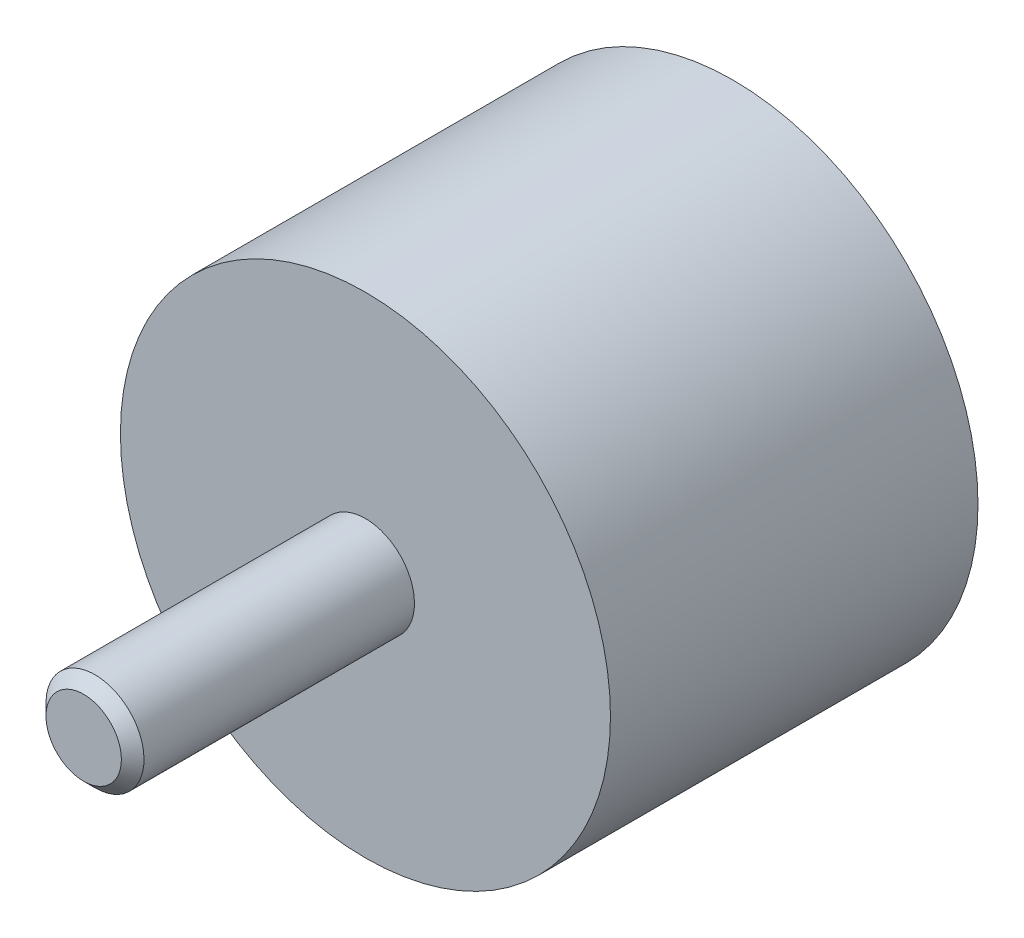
ISO-10303-21;
HEADER;
FILE_DESCRIPTION(('STEP AP214'),'2;1');
FILE_NAME('part.step','',(''),(''),'','','');
FILE_SCHEMA(('AUTOMOTIVE_DESIGN { 1 0 10303 214 1 1 1 1 }'));
ENDSEC;
DATA;
#1=APPLICATION_CONTEXT('core data for automotive mechanical design processes');
#2=APPLICATION_PROTOCOL_DEFINITION('international standard','automotive_design',2000,#1);
#3=PRODUCT_CONTEXT('',#1,'mechanical');
#4=PRODUCT('Part','Part','',(#3));
#5=PRODUCT_RELATED_PRODUCT_CATEGORY('part','',(#4));
#6=PRODUCT_DEFINITION_FORMATION('','',#4);
#7=PRODUCT_DEFINITION_CONTEXT('part definition',#1,'design');
#8=PRODUCT_DEFINITION('design','',#6,#7);
#9=PRODUCT_DEFINITION_SHAPE('','',#8);
#10=(LENGTH_UNIT() NAMED_UNIT(*) SI_UNIT(.MILLI.,.METRE.));
#11=(NAMED_UNIT(*) PLANE_ANGLE_UNIT() SI_UNIT($,.RADIAN.));
#12=(NAMED_UNIT(*) SI_UNIT($,.STERADIAN.) SOLID_ANGLE_UNIT());
#13=UNCERTAINTY_MEASURE_WITH_UNIT(LENGTH_MEASURE(1.E-05),#10,'distance_accuracy_value','');
#14=(GEOMETRIC_REPRESENTATION_CONTEXT(3) GLOBAL_UNCERTAINTY_ASSIGNED_CONTEXT((#13)) GLOBAL_UNIT_ASSIGNED_CONTEXT((#10,
#11,#12)) REPRESENTATION_CONTEXT('',''));
#15=CARTESIAN_POINT('',(0.,0.,0.));
#16=DIRECTION('',(0.,0.,1.));
#17=DIRECTION('',(1.,0.,0.));
#18=AXIS2_PLACEMENT_3D('',#15,#16,#17);
#19=CARTESIAN_POINT('',(0.,0.,0.));
#20=DIRECTION('',(0.,0.,1.));
#21=DIRECTION('',(0.,-1.,0.));
#22=AXIS2_PLACEMENT_3D('',#19,#20,#21);
#23=CYLINDRICAL_SURFACE('',#22,20.);
#24=CARTESIAN_POINT('',(0.,0.,0.));
#25=DIRECTION('',(0.,0.,1.));
#26=DIRECTION('',(0.,-1.,0.));
#27=AXIS2_PLACEMENT_3D('',#24,#25,#26);
#28=CIRCLE('',#27,20.);
#29=CARTESIAN_POINT('',(0.,-20.,0.));
#30=VERTEX_POINT('',#29);
#31=EDGE_CURVE('E8',#30,#30,#28,.T.);
#32=ORIENTED_EDGE('',*,*,#31,.T.);
#33=EDGE_LOOP('',(#32));
#34=FACE_BOUND('',#33,.T.);
#35=CARTESIAN_POINT('',(0.,0.,30.));
#36=DIRECTION('',(0.,0.,1.));
#37=DIRECTION('',(0.,-1.,0.));
#38=AXIS2_PLACEMENT_3D('',#35,#36,#37);
#39=CIRCLE('',#38,20.);
#40=CARTESIAN_POINT('',(0.,-20.,30.));
#41=VERTEX_POINT('',#40);
#42=EDGE_CURVE('E18',#41,#41,#39,.T.);
#43=ORIENTED_EDGE('',*,*,#42,.F.);
#44=EDGE_LOOP('',(#43));
#45=FACE_BOUND('',#44,.T.);
#46=ADVANCED_FACE('F12',(#34,#45),#23,.T.);
#47=CARTESIAN_POINT('',(20.,0.,0.));
#48=DIRECTION('',(0.,0.,-1.));
#49=DIRECTION('',(0.,1.,0.));
#50=AXIS2_PLACEMENT_3D('',#47,#48,#49);
#51=PLANE('',#50);
#52=ORIENTED_EDGE('',*,*,#31,.F.);
#53=EDGE_LOOP('',(#52));
#54=FACE_BOUND('',#53,.T.);
#55=ADVANCED_FACE('F52',(#54),#51,.T.);
#56=CARTESIAN_POINT('',(20.,0.,30.));
#57=DIRECTION('',(0.,0.,-1.));
#58=DIRECTION('',(0.,1.,0.));
#59=AXIS2_PLACEMENT_3D('',#56,#57,#58);
#60=PLANE('',#59);
#61=CARTESIAN_POINT('',(0.,0.,30.));
#62=DIRECTION('',(0.,0.,1.));
#63=DIRECTION('',(0.,-1.,0.));
#64=AXIS2_PLACEMENT_3D('',#61,#62,#63);
#65=CIRCLE('',#64,4.);
#66=CARTESIAN_POINT('',(0.,-4.,30.));
#67=VERTEX_POINT('',#66);
#68=EDGE_CURVE('E22',#67,#67,#65,.T.);
#69=ORIENTED_EDGE('',*,*,#68,.F.);
#70=EDGE_LOOP('',(#69));
#71=FACE_BOUND('',#70,.T.);
#72=ORIENTED_EDGE('',*,*,#42,.T.);
#73=EDGE_LOOP('',(#72));
#74=FACE_BOUND('',#73,.T.);
#75=ADVANCED_FACE('F45',(#71,#74),#60,.F.);
#76=CARTESIAN_POINT('',(0.,0.,20.));
#77=DIRECTION('',(0.,0.,1.));
#78=DIRECTION('',(0.,-1.,0.));
#79=AXIS2_PLACEMENT_3D('',#76,#77,#78);
#80=CYLINDRICAL_SURFACE('',#79,4.);
#81=ORIENTED_EDGE('',*,*,#68,.T.);
#82=EDGE_LOOP('',(#81));
#83=FACE_BOUND('',#82,.T.);
#84=CARTESIAN_POINT('',(0.,0.,52.0763248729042));
#85=DIRECTION('',(0.,0.,1.));
#86=DIRECTION('',(0.,-1.,0.));
#87=AXIS2_PLACEMENT_3D('',#84,#85,#86);
#88=CIRCLE('',#87,4.);
#89=CARTESIAN_POINT('',(0.,-4.,52.0763248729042));
#90=VERTEX_POINT('',#89);
#91=EDGE_CURVE('E26',#90,#90,#88,.T.);
#92=ORIENTED_EDGE('',*,*,#91,.F.);
#93=EDGE_LOOP('',(#92));
#94=FACE_BOUND('',#93,.T.);
#95=ADVANCED_FACE('F40',(#83,#94),#80,.T.);
#96=CARTESIAN_POINT('',(0.,0.,52.0763248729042));
#97=DIRECTION('',(0.,0.,-1.));
#98=DIRECTION('',(0.,1.,0.));
#99=AXIS2_PLACEMENT_3D('',#96,#97,#98);
#100=CONICAL_SURFACE('',#99,4.,0.785398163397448);
#101=CARTESIAN_POINT('',(0.,0.,53.));
#102=DIRECTION('',(0.,0.,1.));
#103=DIRECTION('',(0.,-1.,0.));
#104=AXIS2_PLACEMENT_3D('',#101,#102,#103);
#105=CIRCLE('',#104,3.07632487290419);
#106=CARTESIAN_POINT('',(0.,-3.07632487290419,53.));
#107=VERTEX_POINT('',#106);
#108=EDGE_CURVE('E31',#107,#107,#105,.T.);
#109=ORIENTED_EDGE('',*,*,#108,.F.);
#110=EDGE_LOOP('',(#109));
#111=FACE_BOUND('',#110,.T.);
#112=ORIENTED_EDGE('',*,*,#91,.T.);
#113=EDGE_LOOP('',(#112));
#114=FACE_BOUND('',#113,.T.);
#115=ADVANCED_FACE('F37',(#111,#114),#100,.T.);
#116=CARTESIAN_POINT('',(3.07632487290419,0.,53.));
#117=DIRECTION('',(0.,0.,-1.));
#118=DIRECTION('',(0.,1.,0.));
#119=AXIS2_PLACEMENT_3D('',#116,#117,#118);
#120=PLANE('',#119);
#121=ORIENTED_EDGE('',*,*,#108,.T.);
#122=EDGE_LOOP('',(#121));
#123=FACE_BOUND('',#122,.T.);
#124=ADVANCED_FACE('F35',(#123),#120,.F.);
#125=CLOSED_SHELL('',(#46,#55,#75,#95,#115,#124));
#126=MANIFOLD_SOLID_BREP('B1',#125);
#127=ADVANCED_BREP_SHAPE_REPRESENTATION('',(#18,#126),#14);
#128=SHAPE_DEFINITION_REPRESENTATION(#9,#127);
ENDSEC;
END-ISO-10303-21;
